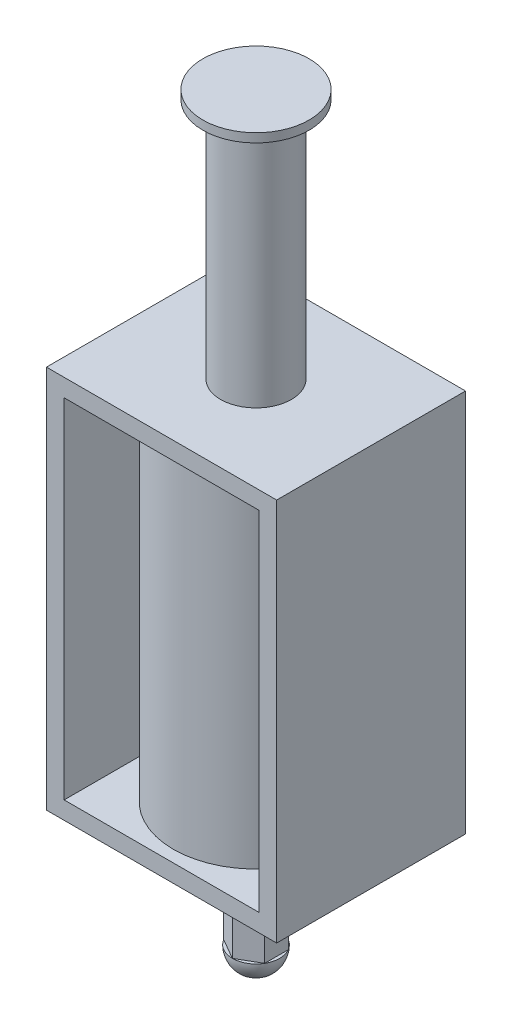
from build123d import *

# Parameters (mm, degrees)
SKETCH_1_W          = 39
SKETCH_1_H          = 65
EXTRUDE_1_DEPTH     = 32
SKETCH_2_W          = 33
SKETCH_2_H          = 59
CUT_EXTRUDE_1_DEPTH = 32
SKETCH_3_R          = 6
EXTRUDE_2_DEPTH     = 41
SKETCH_4_R          = 9
EXTRUDE_3_DEPTH     = 1.5
SKETCH_5_R          = 14
EXTRUDE_4_DEPTH     = 59
SKETCH_6_R          = 4
EXTRUDE_5_DEPTH     = 18
SKETCH_7_OUTSIDE_W  = 68.052
SKETCH_7_OUTSIDE_H  = 61.052
CUT_EXTRUDE_2_DEPTH = 11


with BuildPart() as part:
    # Sketch 1 → Extrude 1 (new body)
    with BuildSketch(Plane.XY):
        Rectangle(SKETCH_1_W, SKETCH_1_H)
    extrude(amount=EXTRUDE_1_DEPTH)

    # Sketch 2 → Cut-Extrude 1 (cut)
    with BuildSketch(Plane.XY.offset(32)):
        Rectangle(SKETCH_2_W, SKETCH_2_H)
    extrude(amount=-CUT_EXTRUDE_1_DEPTH, mode=Mode.SUBTRACT)

    # Sketch 3 → Extrude 2 (add)
    with BuildSketch(Plane(origin=(0, 32.5, 0), x_dir=(1, 0, 0), z_dir=(0, 1, 0))):
        with Locations(Location((0, -16, 0), (0, 0, 270))):
            Circle(SKETCH_3_R)
    extrude(amount=EXTRUDE_2_DEPTH)

    # Sketch 4 → Extrude 3 (add)
    with BuildSketch(Plane(origin=(0, 73.5, 0), x_dir=(1, 0, 0), z_dir=(0, 1, 0))):
        with Locations(Location((0, -16, 0), (0, 0, 270))):
            Circle(SKETCH_4_R)
    extrude(amount=EXTRUDE_3_DEPTH)

    # Sketch 5 → Extrude 4 (add)
    with BuildSketch(Plane.XZ.offset(-29.5)):
        with Locations(Location((0, 16, 0), (0, 0, 90))):
            Circle(SKETCH_5_R)
    extrude(amount=EXTRUDE_4_DEPTH)

    # Sketch 6 → Extrude 5 (add)
    with BuildSketch(Plane.XZ.offset(32.5)):
        with Locations(Location((0, 16, 0), (0, 0, 270))):
            Circle(SKETCH_6_R)
    extrude(amount=EXTRUDE_5_DEPTH)

    # Sketch 7 outside → Cut-Extrude 2 (cut)
    with BuildSketch(Plane.XZ.offset(50.5)):
        with Locations((0, 16)):
            Rectangle(SKETCH_7_OUTSIDE_W, SKETCH_7_OUTSIDE_H)
        Polygon((0, 20), (3.464101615, 18), (3.464101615, 14), (0, 12), (-3.464101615, 14), (-3.464101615, 18), align=None, mode=Mode.SUBTRACT)
    extrude(amount=-CUT_EXTRUDE_2_DEPTH, mode=Mode.SUBTRACT)

    # Sketch 9 → Revolve 8 (revolve)
    with BuildSketch(Plane(origin=(6.92820323, 0, 12), x_dir=(0.8660254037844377, 0, -0.5000000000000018), z_dir=(0.5000000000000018, 0, 0.8660254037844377)), mode=Mode.PRIVATE) as revolve_8_sk:
        with BuildLine():
            Line((-8, -50.5), (-8, -54.5))
            ThreePointArc((-8, -54.5), (-5.171572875, -53.328427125), (-4, -50.5))
            Line((-4, -50.5), (-8, -50.5))
        make_face()
    revolve(revolve_8_sk.sketch.rotate(Axis((0, -50.5, 16), (0, -1, 0)), 180), axis=Axis((0, -50.5, 16), (0, -1, 0)))


solid = part.part
